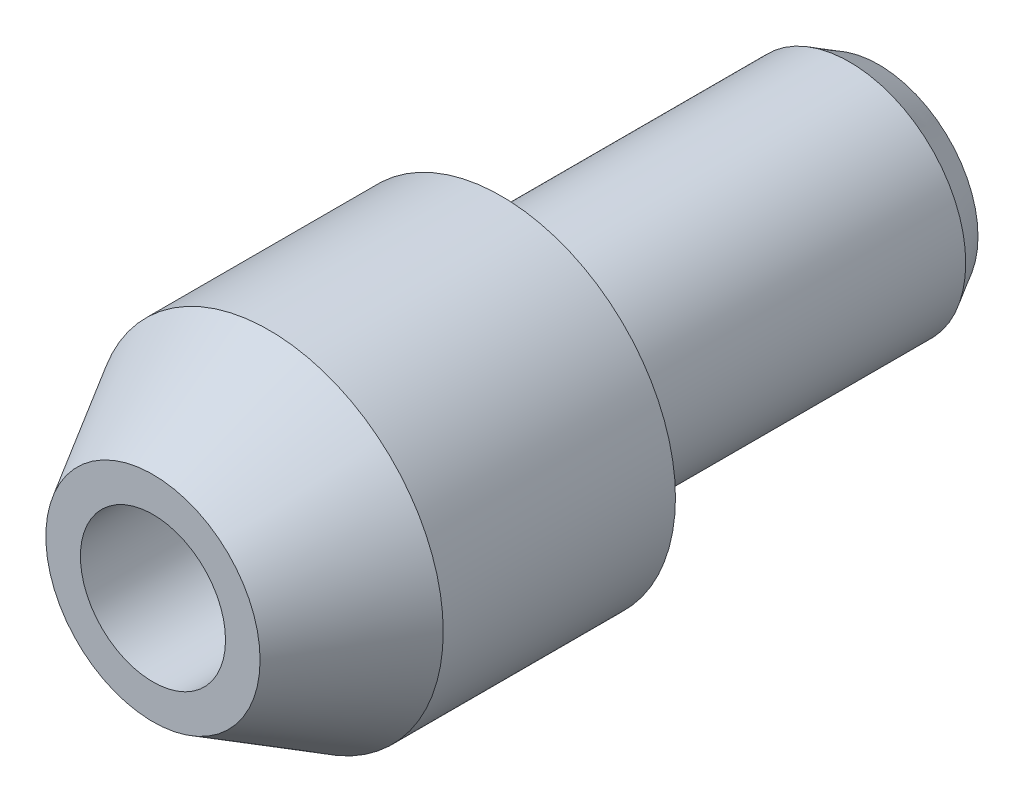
ISO-10303-21;
HEADER;
FILE_DESCRIPTION(('STEP AP214'),'2;1');
FILE_NAME('part.step','',(''),(''),'','','');
FILE_SCHEMA(('AUTOMOTIVE_DESIGN { 1 0 10303 214 1 1 1 1 }'));
ENDSEC;
DATA;
#1=APPLICATION_CONTEXT('core data for automotive mechanical design processes');
#2=APPLICATION_PROTOCOL_DEFINITION('international standard','automotive_design',2000,#1);
#3=PRODUCT_CONTEXT('',#1,'mechanical');
#4=PRODUCT('Part','Part','',(#3));
#5=PRODUCT_RELATED_PRODUCT_CATEGORY('part','',(#4));
#6=PRODUCT_DEFINITION_FORMATION('','',#4);
#7=PRODUCT_DEFINITION_CONTEXT('part definition',#1,'design');
#8=PRODUCT_DEFINITION('design','',#6,#7);
#9=PRODUCT_DEFINITION_SHAPE('','',#8);
#10=(LENGTH_UNIT() NAMED_UNIT(*) SI_UNIT(.MILLI.,.METRE.));
#11=(NAMED_UNIT(*) PLANE_ANGLE_UNIT() SI_UNIT($,.RADIAN.));
#12=(NAMED_UNIT(*) SI_UNIT($,.STERADIAN.) SOLID_ANGLE_UNIT());
#13=UNCERTAINTY_MEASURE_WITH_UNIT(LENGTH_MEASURE(1.E-05),#10,'distance_accuracy_value','');
#14=(GEOMETRIC_REPRESENTATION_CONTEXT(3) GLOBAL_UNCERTAINTY_ASSIGNED_CONTEXT((#13)) GLOBAL_UNIT_ASSIGNED_CONTEXT((#10,
#11,#12)) REPRESENTATION_CONTEXT('',''));
#15=CARTESIAN_POINT('',(0.,0.,0.));
#16=DIRECTION('',(0.,0.,1.));
#17=DIRECTION('',(1.,0.,0.));
#18=AXIS2_PLACEMENT_3D('',#15,#16,#17);
#19=CARTESIAN_POINT('',(0.,0.,-12.));
#20=DIRECTION('',(0.,0.,1.));
#21=DIRECTION('',(1.,0.,0.));
#22=AXIS2_PLACEMENT_3D('',#19,#20,#21);
#23=CONICAL_SURFACE('',#22,4.,0.523598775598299);
#24=CARTESIAN_POINT('',(0.,0.,-13.));
#25=DIRECTION('',(0.,0.,1.));
#26=DIRECTION('',(1.,0.,0.));
#27=AXIS2_PLACEMENT_3D('',#24,#25,#26);
#28=CIRCLE('',#27,3.42264973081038);
#29=CARTESIAN_POINT('',(3.42264973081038,0.,-13.));
#30=VERTEX_POINT('',#29);
#31=EDGE_CURVE('E43',#30,#30,#28,.T.);
#32=ORIENTED_EDGE('',*,*,#31,.T.);
#33=EDGE_LOOP('',(#32));
#34=FACE_BOUND('',#33,.T.);
#35=CARTESIAN_POINT('',(0.,0.,-12.));
#36=DIRECTION('',(0.,0.,1.));
#37=DIRECTION('',(1.,0.,0.));
#38=AXIS2_PLACEMENT_3D('',#35,#36,#37);
#39=CIRCLE('',#38,4.);
#40=CARTESIAN_POINT('',(4.,0.,-12.));
#41=VERTEX_POINT('',#40);
#42=EDGE_CURVE('E8',#41,#41,#39,.T.);
#43=ORIENTED_EDGE('',*,*,#42,.F.);
#44=EDGE_LOOP('',(#43));
#45=FACE_BOUND('',#44,.T.);
#46=ADVANCED_FACE('F12',(#34,#45),#23,.T.);
#47=CARTESIAN_POINT('',(0.,0.,20.));
#48=DIRECTION('',(0.,0.,1.));
#49=DIRECTION('',(1.,0.,0.));
#50=AXIS2_PLACEMENT_3D('',#47,#48,#49);
#51=CYLINDRICAL_SURFACE('',#50,4.);
#52=ORIENTED_EDGE('',*,*,#42,.T.);
#53=EDGE_LOOP('',(#52));
#54=FACE_BOUND('',#53,.T.);
#55=CARTESIAN_POINT('',(0.,0.,0.));
#56=DIRECTION('',(0.,0.,1.));
#57=DIRECTION('',(1.,0.,0.));
#58=AXIS2_PLACEMENT_3D('',#55,#56,#57);
#59=CIRCLE('',#58,4.);
#60=CARTESIAN_POINT('',(4.,0.,0.));
#61=VERTEX_POINT('',#60);
#62=EDGE_CURVE('E18',#61,#61,#59,.T.);
#63=ORIENTED_EDGE('',*,*,#62,.F.);
#64=EDGE_LOOP('',(#63));
#65=FACE_BOUND('',#64,.T.);
#66=ADVANCED_FACE('F72',(#54,#65),#51,.T.);
#67=CARTESIAN_POINT('',(4.,0.,0.));
#68=DIRECTION('',(0.,0.,1.));
#69=DIRECTION('',(1.,0.,0.));
#70=AXIS2_PLACEMENT_3D('',#67,#68,#69);
#71=PLANE('',#70);
#72=CARTESIAN_POINT('',(0.,0.,0.));
#73=DIRECTION('',(0.,0.,1.));
#74=DIRECTION('',(1.,0.,0.));
#75=AXIS2_PLACEMENT_3D('',#72,#73,#74);
#76=CIRCLE('',#75,6.);
#77=CARTESIAN_POINT('',(6.,0.,0.));
#78=VERTEX_POINT('',#77);
#79=EDGE_CURVE('E22',#78,#78,#76,.T.);
#80=ORIENTED_EDGE('',*,*,#79,.F.);
#81=EDGE_LOOP('',(#80));
#82=FACE_BOUND('',#81,.T.);
#83=ORIENTED_EDGE('',*,*,#62,.T.);
#84=EDGE_LOOP('',(#83));
#85=FACE_BOUND('',#84,.T.);
#86=ADVANCED_FACE('F77',(#82,#85),#71,.F.);
#87=CARTESIAN_POINT('',(0.,0.,20.));
#88=DIRECTION('',(0.,0.,1.));
#89=DIRECTION('',(1.,0.,0.));
#90=AXIS2_PLACEMENT_3D('',#87,#88,#89);
#91=CYLINDRICAL_SURFACE('',#90,6.);
#92=ORIENTED_EDGE('',*,*,#79,.T.);
#93=EDGE_LOOP('',(#92));
#94=FACE_BOUND('',#93,.T.);
#95=CARTESIAN_POINT('',(0.,0.,8.));
#96=DIRECTION('',(0.,0.,1.));
#97=DIRECTION('',(1.,0.,0.));
#98=AXIS2_PLACEMENT_3D('',#95,#96,#97);
#99=CIRCLE('',#98,6.);
#100=CARTESIAN_POINT('',(6.,0.,8.));
#101=VERTEX_POINT('',#100);
#102=EDGE_CURVE('E26',#101,#101,#99,.T.);
#103=ORIENTED_EDGE('',*,*,#102,.F.);
#104=EDGE_LOOP('',(#103));
#105=FACE_BOUND('',#104,.T.);
#106=ADVANCED_FACE('F68',(#94,#105),#91,.T.);
#107=CARTESIAN_POINT('',(0.,0.,8.));
#108=DIRECTION('',(0.,0.,-1.));
#109=DIRECTION('',(-1.,0.,0.));
#110=AXIS2_PLACEMENT_3D('',#107,#108,#109);
#111=CONICAL_SURFACE('',#110,6.,0.523598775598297);
#112=CARTESIAN_POINT('',(0.,0.,12.));
#113=DIRECTION('',(0.,0.,1.));
#114=DIRECTION('',(1.,0.,0.));
#115=AXIS2_PLACEMENT_3D('',#112,#113,#114);
#116=CIRCLE('',#115,3.69059892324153);
#117=CARTESIAN_POINT('',(3.69059892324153,0.,12.));
#118=VERTEX_POINT('',#117);
#119=EDGE_CURVE('E31',#118,#118,#116,.T.);
#120=ORIENTED_EDGE('',*,*,#119,.F.);
#121=EDGE_LOOP('',(#120));
#122=FACE_BOUND('',#121,.T.);
#123=ORIENTED_EDGE('',*,*,#102,.T.);
#124=EDGE_LOOP('',(#123));
#125=FACE_BOUND('',#124,.T.);
#126=ADVANCED_FACE('F61',(#122,#125),#111,.T.);
#127=CARTESIAN_POINT('',(2.5,0.,12.));
#128=DIRECTION('',(0.,0.,1.));
#129=DIRECTION('',(1.,0.,0.));
#130=AXIS2_PLACEMENT_3D('',#127,#128,#129);
#131=PLANE('',#130);
#132=ORIENTED_EDGE('',*,*,#119,.T.);
#133=EDGE_LOOP('',(#132));
#134=FACE_BOUND('',#133,.T.);
#135=CARTESIAN_POINT('',(0.,0.,12.));
#136=DIRECTION('',(0.,0.,1.));
#137=DIRECTION('',(1.,0.,0.));
#138=AXIS2_PLACEMENT_3D('',#135,#136,#137);
#139=CIRCLE('',#138,2.5);
#140=CARTESIAN_POINT('',(2.5,0.,12.));
#141=VERTEX_POINT('',#140);
#142=EDGE_CURVE('E34',#141,#141,#139,.T.);
#143=ORIENTED_EDGE('',*,*,#142,.F.);
#144=EDGE_LOOP('',(#143));
#145=FACE_BOUND('',#144,.T.);
#146=ADVANCED_FACE('F56',(#134,#145),#131,.T.);
#147=CARTESIAN_POINT('',(0.,0.,20.));
#148=DIRECTION('',(0.,0.,1.));
#149=DIRECTION('',(1.,0.,0.));
#150=AXIS2_PLACEMENT_3D('',#147,#148,#149);
#151=CYLINDRICAL_SURFACE('',#150,2.5);
#152=CARTESIAN_POINT('',(0.,0.,4.));
#153=DIRECTION('',(0.,0.,1.));
#154=DIRECTION('',(1.,0.,0.));
#155=AXIS2_PLACEMENT_3D('',#152,#153,#154);
#156=CIRCLE('',#155,2.5);
#157=CARTESIAN_POINT('',(2.5,0.,4.));
#158=VERTEX_POINT('',#157);
#159=EDGE_CURVE('E46',#158,#158,#156,.T.);
#160=ORIENTED_EDGE('',*,*,#159,.F.);
#161=EDGE_LOOP('',(#160));
#162=FACE_BOUND('',#161,.T.);
#163=ORIENTED_EDGE('',*,*,#142,.T.);
#164=EDGE_LOOP('',(#163));
#165=FACE_BOUND('',#164,.T.);
#166=ADVANCED_FACE('F52',(#162,#165),#151,.F.);
#167=CARTESIAN_POINT('',(0.,0.,-9.));
#168=DIRECTION('',(0.,0.,1.));
#169=DIRECTION('',(1.,0.,0.));
#170=AXIS2_PLACEMENT_3D('',#167,#168,#169);
#171=PLANE('',#170);
#172=CARTESIAN_POINT('',(0.,0.,-9.));
#173=DIRECTION('',(0.,0.,1.));
#174=DIRECTION('',(1.,0.,0.));
#175=AXIS2_PLACEMENT_3D('',#172,#173,#174);
#176=CIRCLE('',#175,1.);
#177=CARTESIAN_POINT('',(1.,0.,-9.));
#178=VERTEX_POINT('',#177);
#179=EDGE_CURVE('E37',#178,#178,#176,.T.);
#180=ORIENTED_EDGE('',*,*,#179,.F.);
#181=EDGE_LOOP('',(#180));
#182=FACE_BOUND('',#181,.T.);
#183=ADVANCED_FACE('F55',(#182),#171,.F.);
#184=CARTESIAN_POINT('',(0.,0.,20.));
#185=DIRECTION('',(0.,0.,1.));
#186=DIRECTION('',(1.,0.,0.));
#187=AXIS2_PLACEMENT_3D('',#184,#185,#186);
#188=CYLINDRICAL_SURFACE('',#187,1.);
#189=CARTESIAN_POINT('',(0.,0.,-13.));
#190=DIRECTION('',(0.,0.,1.));
#191=DIRECTION('',(1.,0.,0.));
#192=AXIS2_PLACEMENT_3D('',#189,#190,#191);
#193=CIRCLE('',#192,1.);
#194=CARTESIAN_POINT('',(1.,0.,-13.));
#195=VERTEX_POINT('',#194);
#196=EDGE_CURVE('E40',#195,#195,#193,.T.);
#197=ORIENTED_EDGE('',*,*,#196,.F.);
#198=EDGE_LOOP('',(#197));
#199=FACE_BOUND('',#198,.T.);
#200=ORIENTED_EDGE('',*,*,#179,.T.);
#201=EDGE_LOOP('',(#200));
#202=FACE_BOUND('',#201,.T.);
#203=ADVANCED_FACE('F84',(#199,#202),#188,.F.);
#204=CARTESIAN_POINT('',(1.,0.,-13.));
#205=DIRECTION('',(0.,0.,1.));
#206=DIRECTION('',(1.,0.,0.));
#207=AXIS2_PLACEMENT_3D('',#204,#205,#206);
#208=PLANE('',#207);
#209=ORIENTED_EDGE('',*,*,#31,.F.);
#210=EDGE_LOOP('',(#209));
#211=FACE_BOUND('',#210,.T.);
#212=ORIENTED_EDGE('',*,*,#196,.T.);
#213=EDGE_LOOP('',(#212));
#214=FACE_BOUND('',#213,.T.);
#215=ADVANCED_FACE('F81',(#211,#214),#208,.F.);
#216=CARTESIAN_POINT('',(0.,0.,4.));
#217=DIRECTION('',(0.,0.,1.));
#218=DIRECTION('',(1.,0.,0.));
#219=AXIS2_PLACEMENT_3D('',#216,#217,#218);
#220=PLANE('',#219);
#221=ORIENTED_EDGE('',*,*,#159,.T.);
#222=EDGE_LOOP('',(#221));
#223=FACE_BOUND('',#222,.T.);
#224=ADVANCED_FACE('F50',(#223),#220,.T.);
#225=CLOSED_SHELL('',(#46,#66,#86,#106,#126,#146,#166,#183,#203,#215,#224));
#226=MANIFOLD_SOLID_BREP('B1',#225);
#227=ADVANCED_BREP_SHAPE_REPRESENTATION('',(#18,#226),#14);
#228=SHAPE_DEFINITION_REPRESENTATION(#9,#227);
ENDSEC;
END-ISO-10303-21;
